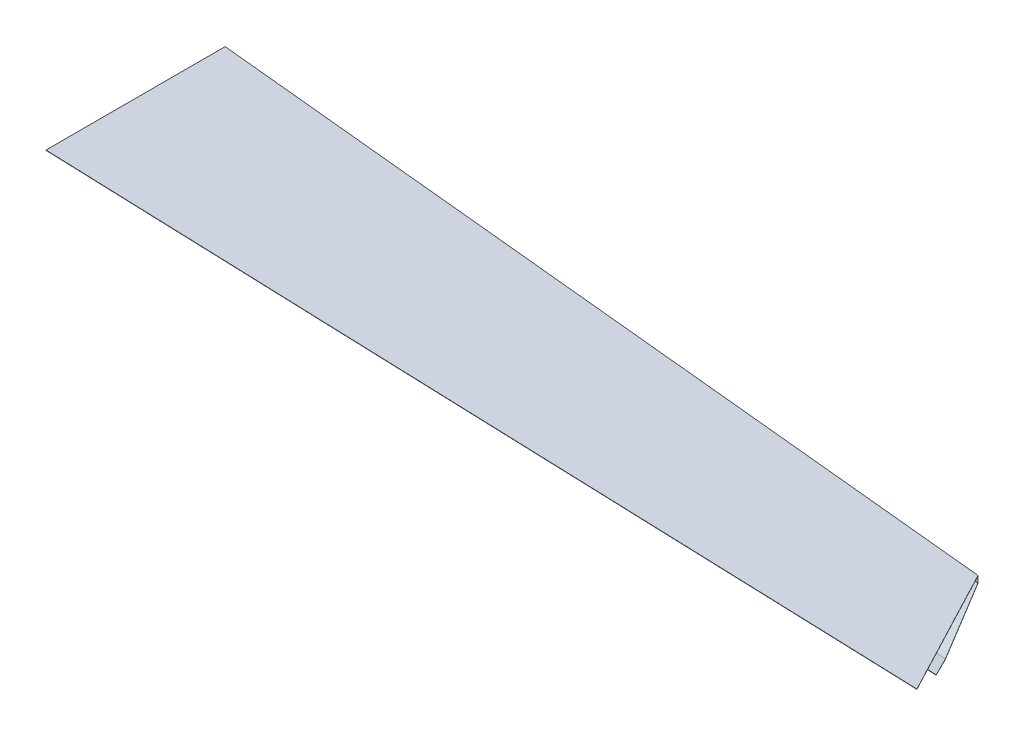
from build123d import *

# Parameters (mm, degrees)
BOSS_EXTRUDE1_DEPTH = 1.6256
THICKEN1_T1         = 1.6256
BOSS_EXTRUDE2_DEPTH = 1.6256
CUT_EXTRUDE1_DEPTH  = 32.766
BOSS_EXTRUDE3_DEPTH = 1.6256


with BuildPart() as part:
    # Sketch1 → Boss-Extrude1 (new body)
    with BuildSketch(Plane(origin=(0, 0, 0), x_dir=(1, 0, 0), z_dir=(0, 1, 0))):
        Polygon((-2552.7, 1588.619713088), (2159.318298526, 1128.037374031), (2189.576209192, 1125.079775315), (2571.719666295, 398.826397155), (2542.483260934, 399.842652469), (-2552.7, 576.950850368), (-2578.1, 577.833752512), (-2578.1, 1591.102469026), align=None)
    extrude(amount=-BOSS_EXTRUDE1_DEPTH)

    # 3DSketch2 → Surface-Fill1: a flat surface bounded by the sketch
    with BuildSketch(Plane(origin=(2189.576209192, 0, -1125.079775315), x_dir=(-0.9952253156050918, -0.0079531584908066, -0.09727958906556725), z_dir=(-0.09728266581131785, 6.960359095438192e-14, 0.9952567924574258)), mode=Mode.PRIVATE) as surface_fill1_1_region:
        Polygon((0, 0), (4790.246556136, -38.098795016), (4790.549571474, 0), (0.303015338, 38.098795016), align=None)
    surface_fill1_1 = surface_fill1_1_region.sketch.faces()[0]
    add(Solid.thicken(surface_fill1_1, THICKEN1_T1))



with BuildPart() as body_2:
    # Sketch4 → Boss-Extrude2 (new body)
    with BuildSketch(Plane(origin=(0.628667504, -88.790925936, 4.760383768), x_dir=(-0.9980711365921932, -0.010348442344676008, -0.06121205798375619), z_dir=(0.007069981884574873, -0.9985409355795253, 0.053535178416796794))):
        Polygon((-2404.846940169, 782.280333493), (-2339.199100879, 890.230333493), (2637.578237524, 890.230333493), (2630.9484383, 782.280333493), align=None)
    extrude(amount=BOSS_EXTRUDE2_DEPTH)

    # 3DSketch4 → Cut-Extrude1 (cut)
    with BuildSketch(Plane(origin=(2681.783406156, -110.539416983, -724.608139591), x_dir=(-0.9945838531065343, -0.012573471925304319, -0.10317396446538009), z_dir=(-0.0070699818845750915, 0.9985409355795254, -0.053535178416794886))):
        Polygon((0, 0), (5708.530425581, 304.367676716), (5724.758714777, 0), align=None)
    extrude(amount=CUT_EXTRUDE1_DEPTH, mode=Mode.SUBTRACT)


with BuildPart() as part_1:
    add(part.part)

    add(body_2.part)  # Boss-Extrude3 merges body 2
    # Sketch5 → Boss-Extrude3 (add)
    with BuildSketch(Plane(origin=(6.04000778, -300.572395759, -61.792701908), x_dir=(0.9998063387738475, 0.01927641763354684, 0.003962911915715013), z_dir=(-0.01967955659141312, 0.9793251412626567, 0.20133301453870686))):
        Polygon((2384.655588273, 701.270452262), (-2583.505329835, 935.797748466), (-2584.640552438, 1550.836199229), (2183.959149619, 1094.360057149), align=None)
    extrude(amount=BOSS_EXTRUDE3_DEPTH)


with BuildPart() as body_2_2:
    # Split1: the piece on the far side of the plane
    add(part_1.part)
    split(bisect_by=Plane(origin=(2155.954412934, 0, -1134.430348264), x_dir=(-0.46565562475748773, 0, -0.8849660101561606), z_dir=(-0.8849660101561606, 0, 0.46565562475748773)), keep=Keep.BOTTOM)


with BuildPart() as part_2:
    add(part_1.part)

    # Split1
    split(bisect_by=Plane(origin=(2155.954412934, 0, -1134.430348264), x_dir=(-0.46565562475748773, 0, -0.8849660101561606), z_dir=(-0.8849660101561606, 0, 0.46565562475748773)), keep=Keep.TOP)


with BuildPart() as body_3:
    # Split2: the piece on the far side of the plane
    add(part_2.part)
    split(bisect_by=Plane(origin=(-2552.7, 0, 0), x_dir=(0, 0, -1), z_dir=(-1, 0, 0)), keep=Keep.BOTTOM)


with BuildPart() as part_3:
    add(part_2.part)

    # Split2
    split(bisect_by=Plane(origin=(-2552.7, 0, 0), x_dir=(0, 0, -1), z_dir=(-1, 0, 0)), keep=Keep.TOP)


solid = body_3.part
